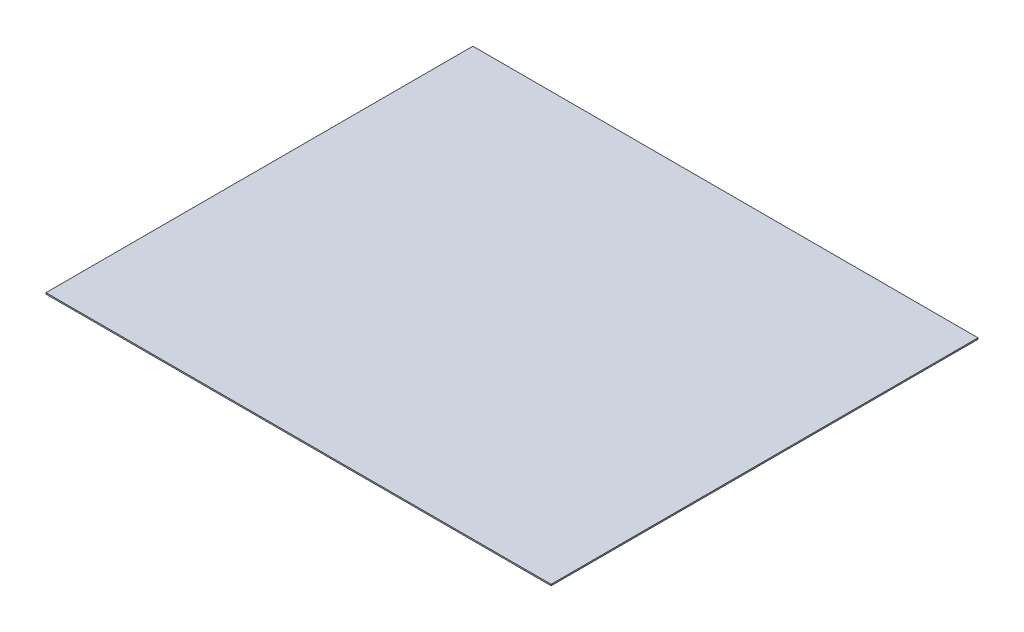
ISO-10303-21;
HEADER;
FILE_DESCRIPTION(('STEP AP214'),'2;1');
FILE_NAME('part.step','',(''),(''),'','','');
FILE_SCHEMA(('AUTOMOTIVE_DESIGN { 1 0 10303 214 1 1 1 1 }'));
ENDSEC;
DATA;
#1=APPLICATION_CONTEXT('core data for automotive mechanical design processes');
#2=APPLICATION_PROTOCOL_DEFINITION('international standard','automotive_design',2000,#1);
#3=PRODUCT_CONTEXT('',#1,'mechanical');
#4=PRODUCT('Part','Part','',(#3));
#5=PRODUCT_RELATED_PRODUCT_CATEGORY('part','',(#4));
#6=PRODUCT_DEFINITION_FORMATION('','',#4);
#7=PRODUCT_DEFINITION_CONTEXT('part definition',#1,'design');
#8=PRODUCT_DEFINITION('design','',#6,#7);
#9=PRODUCT_DEFINITION_SHAPE('','',#8);
#10=(LENGTH_UNIT() NAMED_UNIT(*) SI_UNIT(.MILLI.,.METRE.));
#11=(NAMED_UNIT(*) PLANE_ANGLE_UNIT() SI_UNIT($,.RADIAN.));
#12=(NAMED_UNIT(*) SI_UNIT($,.STERADIAN.) SOLID_ANGLE_UNIT());
#13=UNCERTAINTY_MEASURE_WITH_UNIT(LENGTH_MEASURE(1.E-05),#10,'distance_accuracy_value','');
#14=(GEOMETRIC_REPRESENTATION_CONTEXT(3) GLOBAL_UNCERTAINTY_ASSIGNED_CONTEXT((#13)) GLOBAL_UNIT_ASSIGNED_CONTEXT((#10,
#11,#12)) REPRESENTATION_CONTEXT('',''));
#15=CARTESIAN_POINT('',(0.,0.,0.));
#16=DIRECTION('',(0.,0.,1.));
#17=DIRECTION('',(1.,0.,0.));
#18=AXIS2_PLACEMENT_3D('',#15,#16,#17);
#19=CARTESIAN_POINT('',(901.7,4.7625,-762.));
#20=DIRECTION('',(-1.,0.,0.));
#21=DIRECTION('',(0.,0.,1.));
#22=AXIS2_PLACEMENT_3D('',#19,#20,#21);
#23=PLANE('',#22);
#24=DIRECTION('',(0.,0.,-1.));
#25=VECTOR('',#24,1.);
#26=CARTESIAN_POINT('',(901.7,0.,-762.));
#27=LINE('',#26,#25);
#28=CARTESIAN_POINT('',(901.7,0.,762.));
#29=VERTEX_POINT('',#28);
#30=CARTESIAN_POINT('',(901.7,0.,-762.));
#31=VERTEX_POINT('',#30);
#32=EDGE_CURVE('E98',#29,#31,#27,.T.);
#33=ORIENTED_EDGE('',*,*,#32,.T.);
#34=DIRECTION('',(0.,-1.,0.));
#35=VECTOR('',#34,1.);
#36=CARTESIAN_POINT('',(901.7,4.7625,-762.));
#37=LINE('',#36,#35);
#38=CARTESIAN_POINT('',(901.7,4.7625,-762.));
#39=VERTEX_POINT('',#38);
#40=EDGE_CURVE('E11',#39,#31,#37,.T.);
#41=ORIENTED_EDGE('',*,*,#40,.F.);
#42=DIRECTION('',(0.,0.,-1.));
#43=VECTOR('',#42,1.);
#44=CARTESIAN_POINT('',(901.7,4.7625,-762.));
#45=LINE('',#44,#43);
#46=CARTESIAN_POINT('',(901.7,4.7625,762.));
#47=VERTEX_POINT('',#46);
#48=EDGE_CURVE('E86',#47,#39,#45,.T.);
#49=ORIENTED_EDGE('',*,*,#48,.F.);
#50=DIRECTION('',(0.,-1.,0.));
#51=VECTOR('',#50,1.);
#52=CARTESIAN_POINT('',(901.7,4.7625,762.));
#53=LINE('',#52,#51);
#54=EDGE_CURVE('E94',#47,#29,#53,.T.);
#55=ORIENTED_EDGE('',*,*,#54,.T.);
#56=EDGE_LOOP('',(#33,#41,#49,#55));
#57=FACE_BOUND('',#56,.T.);
#58=ADVANCED_FACE('F35',(#57),#23,.F.);
#59=CARTESIAN_POINT('',(-901.7,4.7625,-762.));
#60=DIRECTION('',(0.,0.,1.));
#61=DIRECTION('',(1.,0.,0.));
#62=AXIS2_PLACEMENT_3D('',#59,#60,#61);
#63=PLANE('',#62);
#64=DIRECTION('',(-1.,0.,0.));
#65=VECTOR('',#64,1.);
#66=CARTESIAN_POINT('',(-901.7,0.,-762.));
#67=LINE('',#66,#65);
#68=CARTESIAN_POINT('',(-901.7,0.,-762.));
#69=VERTEX_POINT('',#68);
#70=EDGE_CURVE('E90',#31,#69,#67,.T.);
#71=ORIENTED_EDGE('',*,*,#70,.T.);
#72=DIRECTION('',(0.,-1.,0.));
#73=VECTOR('',#72,1.);
#74=CARTESIAN_POINT('',(-901.7,4.7625,-762.));
#75=LINE('',#74,#73);
#76=CARTESIAN_POINT('',(-901.7,4.7625,-762.));
#77=VERTEX_POINT('',#76);
#78=EDGE_CURVE('E43',#77,#69,#75,.T.);
#79=ORIENTED_EDGE('',*,*,#78,.F.);
#80=DIRECTION('',(-1.,0.,0.));
#81=VECTOR('',#80,1.);
#82=CARTESIAN_POINT('',(-901.7,4.7625,-762.));
#83=LINE('',#82,#81);
#84=EDGE_CURVE('E81',#39,#77,#83,.T.);
#85=ORIENTED_EDGE('',*,*,#84,.F.);
#86=ORIENTED_EDGE('',*,*,#40,.T.);
#87=EDGE_LOOP('',(#71,#79,#85,#86));
#88=FACE_BOUND('',#87,.T.);
#89=ADVANCED_FACE('F89',(#88),#63,.F.);
#90=CARTESIAN_POINT('',(-901.7,4.7625,-762.));
#91=DIRECTION('',(1.,0.,0.));
#92=DIRECTION('',(0.,0.,-1.));
#93=AXIS2_PLACEMENT_3D('',#90,#91,#92);
#94=PLANE('',#93);
#95=DIRECTION('',(0.,0.,1.));
#96=VECTOR('',#95,1.);
#97=CARTESIAN_POINT('',(-901.7,0.,-762.));
#98=LINE('',#97,#96);
#99=CARTESIAN_POINT('',(-901.7,0.,762.));
#100=VERTEX_POINT('',#99);
#101=EDGE_CURVE('E68',#69,#100,#98,.T.);
#102=ORIENTED_EDGE('',*,*,#101,.T.);
#103=DIRECTION('',(0.,-1.,0.));
#104=VECTOR('',#103,1.);
#105=CARTESIAN_POINT('',(-901.7,4.7625,762.));
#106=LINE('',#105,#104);
#107=CARTESIAN_POINT('',(-901.7,4.7625,762.));
#108=VERTEX_POINT('',#107);
#109=EDGE_CURVE('E91',#108,#100,#106,.T.);
#110=ORIENTED_EDGE('',*,*,#109,.F.);
#111=DIRECTION('',(0.,0.,1.));
#112=VECTOR('',#111,1.);
#113=CARTESIAN_POINT('',(-901.7,4.7625,-762.));
#114=LINE('',#113,#112);
#115=EDGE_CURVE('E84',#77,#108,#114,.T.);
#116=ORIENTED_EDGE('',*,*,#115,.F.);
#117=ORIENTED_EDGE('',*,*,#78,.T.);
#118=EDGE_LOOP('',(#102,#110,#116,#117));
#119=FACE_BOUND('',#118,.T.);
#120=ADVANCED_FACE('F92',(#119),#94,.F.);
#121=CARTESIAN_POINT('',(-901.7,4.7625,762.));
#122=DIRECTION('',(0.,0.,-1.));
#123=DIRECTION('',(-1.,0.,0.));
#124=AXIS2_PLACEMENT_3D('',#121,#122,#123);
#125=PLANE('',#124);
#126=DIRECTION('',(1.,0.,0.));
#127=VECTOR('',#126,1.);
#128=CARTESIAN_POINT('',(-901.7,0.,762.));
#129=LINE('',#128,#127);
#130=EDGE_CURVE('E74',#100,#29,#129,.T.);
#131=ORIENTED_EDGE('',*,*,#130,.T.);
#132=ORIENTED_EDGE('',*,*,#54,.F.);
#133=DIRECTION('',(1.,0.,0.));
#134=VECTOR('',#133,1.);
#135=CARTESIAN_POINT('',(-901.7,4.7625,762.));
#136=LINE('',#135,#134);
#137=EDGE_CURVE('E51',#108,#47,#136,.T.);
#138=ORIENTED_EDGE('',*,*,#137,.F.);
#139=ORIENTED_EDGE('',*,*,#109,.T.);
#140=EDGE_LOOP('',(#131,#132,#138,#139));
#141=FACE_BOUND('',#140,.T.);
#142=ADVANCED_FACE('F105',(#141),#125,.F.);
#143=CARTESIAN_POINT('',(901.7,4.7625,762.));
#144=DIRECTION('',(0.,1.,0.));
#145=DIRECTION('',(0.,0.,1.));
#146=AXIS2_PLACEMENT_3D('',#143,#144,#145);
#147=PLANE('',#146);
#148=ORIENTED_EDGE('',*,*,#48,.T.);
#149=ORIENTED_EDGE('',*,*,#84,.T.);
#150=ORIENTED_EDGE('',*,*,#115,.T.);
#151=ORIENTED_EDGE('',*,*,#137,.T.);
#152=EDGE_LOOP('',(#148,#149,#150,#151));
#153=FACE_BOUND('',#152,.T.);
#154=ADVANCED_FACE('F82',(#153),#147,.T.);
#155=CARTESIAN_POINT('',(901.7,0.,762.));
#156=DIRECTION('',(0.,1.,0.));
#157=DIRECTION('',(0.,0.,1.));
#158=AXIS2_PLACEMENT_3D('',#155,#156,#157);
#159=PLANE('',#158);
#160=ORIENTED_EDGE('',*,*,#32,.F.);
#161=ORIENTED_EDGE('',*,*,#130,.F.);
#162=ORIENTED_EDGE('',*,*,#101,.F.);
#163=ORIENTED_EDGE('',*,*,#70,.F.);
#164=EDGE_LOOP('',(#160,#161,#162,#163));
#165=FACE_BOUND('',#164,.T.);
#166=ADVANCED_FACE('F108',(#165),#159,.F.);
#167=CLOSED_SHELL('',(#58,#89,#120,#142,#154,#166));
#168=MANIFOLD_SOLID_BREP('B2',#167);
#169=ADVANCED_BREP_SHAPE_REPRESENTATION('',(#18,#168),#14);
#170=SHAPE_DEFINITION_REPRESENTATION(#9,#169);
ENDSEC;
END-ISO-10303-21;
